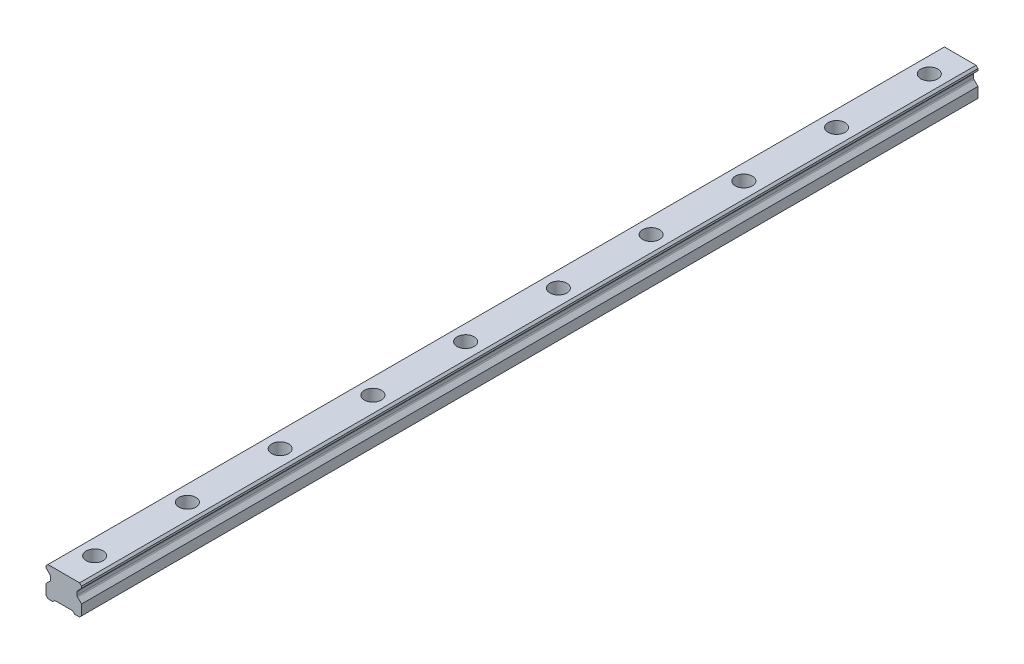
ISO-10303-21;
HEADER;
FILE_DESCRIPTION(('STEP AP214'),'2;1');
FILE_NAME('part.step','',(''),(''),'','','');
FILE_SCHEMA(('AUTOMOTIVE_DESIGN { 1 0 10303 214 1 1 1 1 }'));
ENDSEC;
DATA;
#1=APPLICATION_CONTEXT('core data for automotive mechanical design processes');
#2=APPLICATION_PROTOCOL_DEFINITION('international standard','automotive_design',2000,#1);
#3=PRODUCT_CONTEXT('',#1,'mechanical');
#4=PRODUCT('Part','Part','',(#3));
#5=PRODUCT_RELATED_PRODUCT_CATEGORY('part','',(#4));
#6=PRODUCT_DEFINITION_FORMATION('','',#4);
#7=PRODUCT_DEFINITION_CONTEXT('part definition',#1,'design');
#8=PRODUCT_DEFINITION('design','',#6,#7);
#9=PRODUCT_DEFINITION_SHAPE('','',#8);
#10=(LENGTH_UNIT() NAMED_UNIT(*) SI_UNIT(.MILLI.,.METRE.));
#11=(NAMED_UNIT(*) PLANE_ANGLE_UNIT() SI_UNIT($,.RADIAN.));
#12=(NAMED_UNIT(*) SI_UNIT($,.STERADIAN.) SOLID_ANGLE_UNIT());
#13=UNCERTAINTY_MEASURE_WITH_UNIT(LENGTH_MEASURE(1.E-05),#10,'distance_accuracy_value','');
#14=(GEOMETRIC_REPRESENTATION_CONTEXT(3) GLOBAL_UNCERTAINTY_ASSIGNED_CONTEXT((#13)) GLOBAL_UNIT_ASSIGNED_CONTEXT((#10,
#11,#12)) REPRESENTATION_CONTEXT('',''));
#15=CARTESIAN_POINT('',(0.,0.,0.));
#16=DIRECTION('',(0.,0.,1.));
#17=DIRECTION('',(1.,0.,0.));
#18=AXIS2_PLACEMENT_3D('',#15,#16,#17);
#19=CARTESIAN_POINT('',(0.,10.2,-270.));
#20=DIRECTION('',(0.,1.,0.));
#21=DIRECTION('',(0.,0.,1.));
#22=AXIS2_PLACEMENT_3D('',#19,#20,#21);
#23=PLANE('',#22);
#24=CARTESIAN_POINT('',(0.,10.2,-270.));
#25=DIRECTION('',(0.,1.,0.));
#26=DIRECTION('',(0.,0.,1.));
#27=AXIS2_PLACEMENT_3D('',#24,#25,#26);
#28=CIRCLE('',#27,3.5);
#29=CARTESIAN_POINT('',(0.,10.2,-266.5));
#30=VERTEX_POINT('',#29);
#31=EDGE_CURVE('E421',#30,#30,#28,.T.);
#32=ORIENTED_EDGE('',*,*,#31,.F.);
#33=EDGE_LOOP('',(#32));
#34=FACE_BOUND('',#33,.T.);
#35=CARTESIAN_POINT('',(0.,10.2,-270.));
#36=DIRECTION('',(0.,1.,0.));
#37=DIRECTION('',(0.,0.,1.));
#38=AXIS2_PLACEMENT_3D('',#35,#36,#37);
#39=CIRCLE('',#38,5.5);
#40=CARTESIAN_POINT('',(0.,10.2,-264.5));
#41=VERTEX_POINT('',#40);
#42=EDGE_CURVE('E11',#41,#41,#39,.T.);
#43=ORIENTED_EDGE('',*,*,#42,.T.);
#44=EDGE_LOOP('',(#43));
#45=FACE_BOUND('',#44,.T.);
#46=ADVANCED_FACE('F39',(#34,#45),#23,.T.);
#47=CARTESIAN_POINT('',(0.,10.2,-270.));
#48=DIRECTION('',(0.,1.,0.));
#49=DIRECTION('',(0.,0.,1.));
#50=AXIS2_PLACEMENT_3D('',#47,#48,#49);
#51=CYLINDRICAL_SURFACE('',#50,5.5);
#52=ORIENTED_EDGE('',*,*,#42,.F.);
#53=EDGE_LOOP('',(#52));
#54=FACE_BOUND('',#53,.T.);
#55=CARTESIAN_POINT('',(0.,19.2,-270.));
#56=DIRECTION('',(0.,1.,0.));
#57=DIRECTION('',(0.,0.,1.));
#58=AXIS2_PLACEMENT_3D('',#55,#56,#57);
#59=CIRCLE('',#58,5.5);
#60=CARTESIAN_POINT('',(0.,19.2,-264.5));
#61=VERTEX_POINT('',#60);
#62=EDGE_CURVE('E48',#61,#61,#59,.T.);
#63=ORIENTED_EDGE('',*,*,#62,.T.);
#64=EDGE_LOOP('',(#63));
#65=FACE_BOUND('',#64,.T.);
#66=ADVANCED_FACE('F679',(#54,#65),#51,.F.);
#67=CARTESIAN_POINT('',(0.,10.2,-210.));
#68=DIRECTION('',(0.,1.,0.));
#69=DIRECTION('',(0.,0.,1.));
#70=AXIS2_PLACEMENT_3D('',#67,#68,#69);
#71=PLANE('',#70);
#72=CARTESIAN_POINT('',(0.,10.2,-210.));
#73=DIRECTION('',(0.,1.,0.));
#74=DIRECTION('',(0.,0.,1.));
#75=AXIS2_PLACEMENT_3D('',#72,#73,#74);
#76=CIRCLE('',#75,3.5);
#77=CARTESIAN_POINT('',(0.,10.2,-206.5));
#78=VERTEX_POINT('',#77);
#79=EDGE_CURVE('E426',#78,#78,#76,.T.);
#80=ORIENTED_EDGE('',*,*,#79,.F.);
#81=EDGE_LOOP('',(#80));
#82=FACE_BOUND('',#81,.T.);
#83=CARTESIAN_POINT('',(0.,10.2,-210.));
#84=DIRECTION('',(0.,1.,0.));
#85=DIRECTION('',(0.,0.,1.));
#86=AXIS2_PLACEMENT_3D('',#83,#84,#85);
#87=CIRCLE('',#86,5.5);
#88=CARTESIAN_POINT('',(0.,10.2,-204.5));
#89=VERTEX_POINT('',#88);
#90=EDGE_CURVE('E405',#89,#89,#87,.T.);
#91=ORIENTED_EDGE('',*,*,#90,.T.);
#92=EDGE_LOOP('',(#91));
#93=FACE_BOUND('',#92,.T.);
#94=ADVANCED_FACE('F681',(#82,#93),#71,.T.);
#95=CARTESIAN_POINT('',(0.,10.2,-210.));
#96=DIRECTION('',(0.,1.,0.));
#97=DIRECTION('',(0.,0.,1.));
#98=AXIS2_PLACEMENT_3D('',#95,#96,#97);
#99=CYLINDRICAL_SURFACE('',#98,5.5);
#100=ORIENTED_EDGE('',*,*,#90,.F.);
#101=EDGE_LOOP('',(#100));
#102=FACE_BOUND('',#101,.T.);
#103=CARTESIAN_POINT('',(0.,19.2,-210.));
#104=DIRECTION('',(0.,1.,0.));
#105=DIRECTION('',(0.,0.,1.));
#106=AXIS2_PLACEMENT_3D('',#103,#104,#105);
#107=CIRCLE('',#106,5.5);
#108=CARTESIAN_POINT('',(0.,19.2,-204.5));
#109=VERTEX_POINT('',#108);
#110=EDGE_CURVE('E401',#109,#109,#107,.T.);
#111=ORIENTED_EDGE('',*,*,#110,.T.);
#112=EDGE_LOOP('',(#111));
#113=FACE_BOUND('',#112,.T.);
#114=ADVANCED_FACE('F687',(#102,#113),#99,.F.);
#115=CARTESIAN_POINT('',(0.,10.2,-150.));
#116=DIRECTION('',(0.,1.,0.));
#117=DIRECTION('',(0.,0.,1.));
#118=AXIS2_PLACEMENT_3D('',#115,#116,#117);
#119=PLANE('',#118);
#120=CARTESIAN_POINT('',(0.,10.2,-150.));
#121=DIRECTION('',(0.,1.,0.));
#122=DIRECTION('',(0.,0.,1.));
#123=AXIS2_PLACEMENT_3D('',#120,#121,#122);
#124=CIRCLE('',#123,3.5);
#125=CARTESIAN_POINT('',(0.,10.2,-146.5));
#126=VERTEX_POINT('',#125);
#127=EDGE_CURVE('E431',#126,#126,#124,.T.);
#128=ORIENTED_EDGE('',*,*,#127,.F.);
#129=EDGE_LOOP('',(#128));
#130=FACE_BOUND('',#129,.T.);
#131=CARTESIAN_POINT('',(0.,10.2,-150.));
#132=DIRECTION('',(0.,1.,0.));
#133=DIRECTION('',(0.,0.,1.));
#134=AXIS2_PLACEMENT_3D('',#131,#132,#133);
#135=CIRCLE('',#134,5.5);
#136=CARTESIAN_POINT('',(0.,10.2,-144.5));
#137=VERTEX_POINT('',#136);
#138=EDGE_CURVE('E397',#137,#137,#135,.T.);
#139=ORIENTED_EDGE('',*,*,#138,.T.);
#140=EDGE_LOOP('',(#139));
#141=FACE_BOUND('',#140,.T.);
#142=ADVANCED_FACE('F695',(#130,#141),#119,.T.);
#143=CARTESIAN_POINT('',(0.,10.2,-150.));
#144=DIRECTION('',(0.,1.,0.));
#145=DIRECTION('',(0.,0.,1.));
#146=AXIS2_PLACEMENT_3D('',#143,#144,#145);
#147=CYLINDRICAL_SURFACE('',#146,5.5);
#148=ORIENTED_EDGE('',*,*,#138,.F.);
#149=EDGE_LOOP('',(#148));
#150=FACE_BOUND('',#149,.T.);
#151=CARTESIAN_POINT('',(0.,19.2,-150.));
#152=DIRECTION('',(0.,1.,0.));
#153=DIRECTION('',(0.,0.,1.));
#154=AXIS2_PLACEMENT_3D('',#151,#152,#153);
#155=CIRCLE('',#154,5.5);
#156=CARTESIAN_POINT('',(0.,19.2,-144.5));
#157=VERTEX_POINT('',#156);
#158=EDGE_CURVE('E393',#157,#157,#155,.T.);
#159=ORIENTED_EDGE('',*,*,#158,.T.);
#160=EDGE_LOOP('',(#159));
#161=FACE_BOUND('',#160,.T.);
#162=ADVANCED_FACE('F657',(#150,#161),#147,.F.);
#163=CARTESIAN_POINT('',(0.,10.2,-90.));
#164=DIRECTION('',(0.,1.,0.));
#165=DIRECTION('',(0.,0.,1.));
#166=AXIS2_PLACEMENT_3D('',#163,#164,#165);
#167=PLANE('',#166);
#168=CARTESIAN_POINT('',(0.,10.2,-90.));
#169=DIRECTION('',(0.,1.,0.));
#170=DIRECTION('',(0.,0.,1.));
#171=AXIS2_PLACEMENT_3D('',#168,#169,#170);
#172=CIRCLE('',#171,3.5);
#173=CARTESIAN_POINT('',(0.,10.2,-86.5));
#174=VERTEX_POINT('',#173);
#175=EDGE_CURVE('E436',#174,#174,#172,.T.);
#176=ORIENTED_EDGE('',*,*,#175,.F.);
#177=EDGE_LOOP('',(#176));
#178=FACE_BOUND('',#177,.T.);
#179=CARTESIAN_POINT('',(0.,10.2,-90.));
#180=DIRECTION('',(0.,1.,0.));
#181=DIRECTION('',(0.,0.,1.));
#182=AXIS2_PLACEMENT_3D('',#179,#180,#181);
#183=CIRCLE('',#182,5.5);
#184=CARTESIAN_POINT('',(0.,10.2,-84.5));
#185=VERTEX_POINT('',#184);
#186=EDGE_CURVE('E389',#185,#185,#183,.T.);
#187=ORIENTED_EDGE('',*,*,#186,.T.);
#188=EDGE_LOOP('',(#187));
#189=FACE_BOUND('',#188,.T.);
#190=ADVANCED_FACE('F653',(#178,#189),#167,.T.);
#191=CARTESIAN_POINT('',(0.,10.2,-90.));
#192=DIRECTION('',(0.,1.,0.));
#193=DIRECTION('',(0.,0.,1.));
#194=AXIS2_PLACEMENT_3D('',#191,#192,#193);
#195=CYLINDRICAL_SURFACE('',#194,5.5);
#196=ORIENTED_EDGE('',*,*,#186,.F.);
#197=EDGE_LOOP('',(#196));
#198=FACE_BOUND('',#197,.T.);
#199=CARTESIAN_POINT('',(0.,19.2,-90.));
#200=DIRECTION('',(0.,1.,0.));
#201=DIRECTION('',(0.,0.,1.));
#202=AXIS2_PLACEMENT_3D('',#199,#200,#201);
#203=CIRCLE('',#202,5.5);
#204=CARTESIAN_POINT('',(0.,19.2,-84.5));
#205=VERTEX_POINT('',#204);
#206=EDGE_CURVE('E385',#205,#205,#203,.T.);
#207=ORIENTED_EDGE('',*,*,#206,.T.);
#208=EDGE_LOOP('',(#207));
#209=FACE_BOUND('',#208,.T.);
#210=ADVANCED_FACE('F656',(#198,#209),#195,.F.);
#211=CARTESIAN_POINT('',(0.,10.2,-30.));
#212=DIRECTION('',(0.,1.,0.));
#213=DIRECTION('',(0.,0.,1.));
#214=AXIS2_PLACEMENT_3D('',#211,#212,#213);
#215=PLANE('',#214);
#216=CARTESIAN_POINT('',(0.,10.2,-30.));
#217=DIRECTION('',(0.,1.,0.));
#218=DIRECTION('',(0.,0.,1.));
#219=AXIS2_PLACEMENT_3D('',#216,#217,#218);
#220=CIRCLE('',#219,3.5);
#221=CARTESIAN_POINT('',(0.,10.2,-26.5));
#222=VERTEX_POINT('',#221);
#223=EDGE_CURVE('E441',#222,#222,#220,.T.);
#224=ORIENTED_EDGE('',*,*,#223,.F.);
#225=EDGE_LOOP('',(#224));
#226=FACE_BOUND('',#225,.T.);
#227=CARTESIAN_POINT('',(0.,10.2,-30.));
#228=DIRECTION('',(0.,1.,0.));
#229=DIRECTION('',(0.,0.,1.));
#230=AXIS2_PLACEMENT_3D('',#227,#228,#229);
#231=CIRCLE('',#230,5.5);
#232=CARTESIAN_POINT('',(0.,10.2,-24.5));
#233=VERTEX_POINT('',#232);
#234=EDGE_CURVE('E381',#233,#233,#231,.T.);
#235=ORIENTED_EDGE('',*,*,#234,.T.);
#236=EDGE_LOOP('',(#235));
#237=FACE_BOUND('',#236,.T.);
#238=ADVANCED_FACE('F663',(#226,#237),#215,.T.);
#239=CARTESIAN_POINT('',(0.,10.2,-30.));
#240=DIRECTION('',(0.,1.,0.));
#241=DIRECTION('',(0.,0.,1.));
#242=AXIS2_PLACEMENT_3D('',#239,#240,#241);
#243=CYLINDRICAL_SURFACE('',#242,5.5);
#244=ORIENTED_EDGE('',*,*,#234,.F.);
#245=EDGE_LOOP('',(#244));
#246=FACE_BOUND('',#245,.T.);
#247=CARTESIAN_POINT('',(0.,19.2,-30.));
#248=DIRECTION('',(0.,1.,0.));
#249=DIRECTION('',(0.,0.,1.));
#250=AXIS2_PLACEMENT_3D('',#247,#248,#249);
#251=CIRCLE('',#250,5.5);
#252=CARTESIAN_POINT('',(0.,19.2,-24.5));
#253=VERTEX_POINT('',#252);
#254=EDGE_CURVE('E377',#253,#253,#251,.T.);
#255=ORIENTED_EDGE('',*,*,#254,.T.);
#256=EDGE_LOOP('',(#255));
#257=FACE_BOUND('',#256,.T.);
#258=ADVANCED_FACE('F705',(#246,#257),#243,.F.);
#259=CARTESIAN_POINT('',(0.,10.2,30.));
#260=DIRECTION('',(0.,1.,0.));
#261=DIRECTION('',(0.,0.,1.));
#262=AXIS2_PLACEMENT_3D('',#259,#260,#261);
#263=PLANE('',#262);
#264=CARTESIAN_POINT('',(0.,10.2,30.));
#265=DIRECTION('',(0.,1.,0.));
#266=DIRECTION('',(0.,0.,1.));
#267=AXIS2_PLACEMENT_3D('',#264,#265,#266);
#268=CIRCLE('',#267,3.5);
#269=CARTESIAN_POINT('',(0.,10.2,33.5));
#270=VERTEX_POINT('',#269);
#271=EDGE_CURVE('E445',#270,#270,#268,.T.);
#272=ORIENTED_EDGE('',*,*,#271,.F.);
#273=EDGE_LOOP('',(#272));
#274=FACE_BOUND('',#273,.T.);
#275=CARTESIAN_POINT('',(0.,10.2,30.));
#276=DIRECTION('',(0.,1.,0.));
#277=DIRECTION('',(0.,0.,1.));
#278=AXIS2_PLACEMENT_3D('',#275,#276,#277);
#279=CIRCLE('',#278,5.5);
#280=CARTESIAN_POINT('',(0.,10.2,35.5));
#281=VERTEX_POINT('',#280);
#282=EDGE_CURVE('E373',#281,#281,#279,.T.);
#283=ORIENTED_EDGE('',*,*,#282,.T.);
#284=EDGE_LOOP('',(#283));
#285=FACE_BOUND('',#284,.T.);
#286=ADVANCED_FACE('F709',(#274,#285),#263,.T.);
#287=CARTESIAN_POINT('',(0.,10.2,30.));
#288=DIRECTION('',(0.,1.,0.));
#289=DIRECTION('',(0.,0.,1.));
#290=AXIS2_PLACEMENT_3D('',#287,#288,#289);
#291=CYLINDRICAL_SURFACE('',#290,5.5);
#292=ORIENTED_EDGE('',*,*,#282,.F.);
#293=EDGE_LOOP('',(#292));
#294=FACE_BOUND('',#293,.T.);
#295=CARTESIAN_POINT('',(0.,19.2,30.));
#296=DIRECTION('',(0.,1.,0.));
#297=DIRECTION('',(0.,0.,1.));
#298=AXIS2_PLACEMENT_3D('',#295,#296,#297);
#299=CIRCLE('',#298,5.5);
#300=CARTESIAN_POINT('',(0.,19.2,35.5));
#301=VERTEX_POINT('',#300);
#302=EDGE_CURVE('E369',#301,#301,#299,.T.);
#303=ORIENTED_EDGE('',*,*,#302,.T.);
#304=EDGE_LOOP('',(#303));
#305=FACE_BOUND('',#304,.T.);
#306=ADVANCED_FACE('F713',(#294,#305),#291,.F.);
#307=CARTESIAN_POINT('',(0.,10.2,90.));
#308=DIRECTION('',(0.,1.,0.));
#309=DIRECTION('',(0.,0.,1.));
#310=AXIS2_PLACEMENT_3D('',#307,#308,#309);
#311=PLANE('',#310);
#312=CARTESIAN_POINT('',(0.,10.2,90.));
#313=DIRECTION('',(0.,1.,0.));
#314=DIRECTION('',(0.,0.,1.));
#315=AXIS2_PLACEMENT_3D('',#312,#313,#314);
#316=CIRCLE('',#315,3.5);
#317=CARTESIAN_POINT('',(0.,10.2,93.5));
#318=VERTEX_POINT('',#317);
#319=EDGE_CURVE('E449',#318,#318,#316,.T.);
#320=ORIENTED_EDGE('',*,*,#319,.F.);
#321=EDGE_LOOP('',(#320));
#322=FACE_BOUND('',#321,.T.);
#323=CARTESIAN_POINT('',(0.,10.2,90.));
#324=DIRECTION('',(0.,1.,0.));
#325=DIRECTION('',(0.,0.,1.));
#326=AXIS2_PLACEMENT_3D('',#323,#324,#325);
#327=CIRCLE('',#326,5.5);
#328=CARTESIAN_POINT('',(0.,10.2,95.5));
#329=VERTEX_POINT('',#328);
#330=EDGE_CURVE('E365',#329,#329,#327,.T.);
#331=ORIENTED_EDGE('',*,*,#330,.T.);
#332=EDGE_LOOP('',(#331));
#333=FACE_BOUND('',#332,.T.);
#334=ADVANCED_FACE('F717',(#322,#333),#311,.T.);
#335=CARTESIAN_POINT('',(0.,10.2,90.));
#336=DIRECTION('',(0.,1.,0.));
#337=DIRECTION('',(0.,0.,1.));
#338=AXIS2_PLACEMENT_3D('',#335,#336,#337);
#339=CYLINDRICAL_SURFACE('',#338,5.5);
#340=ORIENTED_EDGE('',*,*,#330,.F.);
#341=EDGE_LOOP('',(#340));
#342=FACE_BOUND('',#341,.T.);
#343=CARTESIAN_POINT('',(0.,19.2,90.));
#344=DIRECTION('',(0.,1.,0.));
#345=DIRECTION('',(0.,0.,1.));
#346=AXIS2_PLACEMENT_3D('',#343,#344,#345);
#347=CIRCLE('',#346,5.5);
#348=CARTESIAN_POINT('',(0.,19.2,95.5));
#349=VERTEX_POINT('',#348);
#350=EDGE_CURVE('E361',#349,#349,#347,.T.);
#351=ORIENTED_EDGE('',*,*,#350,.T.);
#352=EDGE_LOOP('',(#351));
#353=FACE_BOUND('',#352,.T.);
#354=ADVANCED_FACE('F721',(#342,#353),#339,.F.);
#355=CARTESIAN_POINT('',(0.,10.2,150.));
#356=DIRECTION('',(0.,1.,0.));
#357=DIRECTION('',(0.,0.,1.));
#358=AXIS2_PLACEMENT_3D('',#355,#356,#357);
#359=PLANE('',#358);
#360=CARTESIAN_POINT('',(0.,10.2,150.));
#361=DIRECTION('',(0.,1.,0.));
#362=DIRECTION('',(0.,0.,1.));
#363=AXIS2_PLACEMENT_3D('',#360,#361,#362);
#364=CIRCLE('',#363,3.5);
#365=CARTESIAN_POINT('',(0.,10.2,153.5));
#366=VERTEX_POINT('',#365);
#367=EDGE_CURVE('E465',#366,#366,#364,.T.);
#368=ORIENTED_EDGE('',*,*,#367,.F.);
#369=EDGE_LOOP('',(#368));
#370=FACE_BOUND('',#369,.T.);
#371=CARTESIAN_POINT('',(0.,10.2,150.));
#372=DIRECTION('',(0.,1.,0.));
#373=DIRECTION('',(0.,0.,1.));
#374=AXIS2_PLACEMENT_3D('',#371,#372,#373);
#375=CIRCLE('',#374,5.5);
#376=CARTESIAN_POINT('',(0.,10.2,155.5));
#377=VERTEX_POINT('',#376);
#378=EDGE_CURVE('E357',#377,#377,#375,.T.);
#379=ORIENTED_EDGE('',*,*,#378,.T.);
#380=EDGE_LOOP('',(#379));
#381=FACE_BOUND('',#380,.T.);
#382=ADVANCED_FACE('F725',(#370,#381),#359,.T.);
#383=CARTESIAN_POINT('',(0.,10.2,150.));
#384=DIRECTION('',(0.,1.,0.));
#385=DIRECTION('',(0.,0.,1.));
#386=AXIS2_PLACEMENT_3D('',#383,#384,#385);
#387=CYLINDRICAL_SURFACE('',#386,5.5);
#388=ORIENTED_EDGE('',*,*,#378,.F.);
#389=EDGE_LOOP('',(#388));
#390=FACE_BOUND('',#389,.T.);
#391=CARTESIAN_POINT('',(0.,19.2,150.));
#392=DIRECTION('',(0.,1.,0.));
#393=DIRECTION('',(0.,0.,1.));
#394=AXIS2_PLACEMENT_3D('',#391,#392,#393);
#395=CIRCLE('',#394,5.5);
#396=CARTESIAN_POINT('',(0.,19.2,155.5));
#397=VERTEX_POINT('',#396);
#398=EDGE_CURVE('E353',#397,#397,#395,.T.);
#399=ORIENTED_EDGE('',*,*,#398,.T.);
#400=EDGE_LOOP('',(#399));
#401=FACE_BOUND('',#400,.T.);
#402=ADVANCED_FACE('F729',(#390,#401),#387,.F.);
#403=CARTESIAN_POINT('',(11.5,0.,290.));
#404=DIRECTION('',(0.,1.,0.));
#405=DIRECTION('',(-1.,0.,0.));
#406=AXIS2_PLACEMENT_3D('',#403,#404,#405);
#407=PLANE('',#406);
#408=DIRECTION('',(1.,0.,0.));
#409=VECTOR('',#408,1.);
#410=CARTESIAN_POINT('',(11.5,0.,-290.));
#411=LINE('',#410,#409);
#412=CARTESIAN_POINT('',(-10.25,0.,-290.));
#413=VERTEX_POINT('',#412);
#414=CARTESIAN_POINT('',(-7.,0.,-290.));
#415=VERTEX_POINT('',#414);
#416=EDGE_CURVE('E229',#413,#415,#411,.T.);
#417=ORIENTED_EDGE('',*,*,#416,.T.);
#418=DIRECTION('',(0.,0.,1.));
#419=VECTOR('',#418,1.);
#420=CARTESIAN_POINT('',(-7.,0.,-290.));
#421=LINE('',#420,#419);
#422=CARTESIAN_POINT('',(-7.,0.,290.));
#423=VERTEX_POINT('',#422);
#424=EDGE_CURVE('E506',#415,#423,#421,.T.);
#425=ORIENTED_EDGE('',*,*,#424,.T.);
#426=DIRECTION('',(1.,0.,0.));
#427=VECTOR('',#426,1.);
#428=CARTESIAN_POINT('',(11.5,0.,290.));
#429=LINE('',#428,#427);
#430=CARTESIAN_POINT('',(-10.25,0.,290.));
#431=VERTEX_POINT('',#430);
#432=EDGE_CURVE('E574',#431,#423,#429,.T.);
#433=ORIENTED_EDGE('',*,*,#432,.F.);
#434=DIRECTION('',(0.,0.,-1.));
#435=VECTOR('',#434,1.);
#436=CARTESIAN_POINT('',(-10.25,0.,290.));
#437=LINE('',#436,#435);
#438=EDGE_CURVE('E289',#431,#413,#437,.T.);
#439=ORIENTED_EDGE('',*,*,#438,.T.);
#440=EDGE_LOOP('',(#417,#425,#433,#439));
#441=FACE_BOUND('',#440,.T.);
#442=ADVANCED_FACE('F733',(#441),#407,.F.);
#443=CARTESIAN_POINT('',(-11.5,19.2,290.));
#444=DIRECTION('',(1.,0.,0.));
#445=DIRECTION('',(0.,1.,0.));
#446=AXIS2_PLACEMENT_3D('',#443,#444,#445);
#447=PLANE('',#446);
#448=DIRECTION('',(0.,-1.,0.));
#449=VECTOR('',#448,1.);
#450=CARTESIAN_POINT('',(-11.5,19.2,290.));
#451=LINE('',#450,#449);
#452=CARTESIAN_POINT('',(-11.5,17.95,290.));
#453=VERTEX_POINT('',#452);
#454=CARTESIAN_POINT('',(-11.5,16.7,290.));
#455=VERTEX_POINT('',#454);
#456=EDGE_CURVE('E570',#453,#455,#451,.T.);
#457=ORIENTED_EDGE('',*,*,#456,.F.);
#458=DIRECTION('',(0.,0.,-1.));
#459=VECTOR('',#458,1.);
#460=CARTESIAN_POINT('',(-11.5,17.95,290.));
#461=LINE('',#460,#459);
#462=CARTESIAN_POINT('',(-11.5,17.95,-290.));
#463=VERTEX_POINT('',#462);
#464=EDGE_CURVE('E251',#453,#463,#461,.T.);
#465=ORIENTED_EDGE('',*,*,#464,.T.);
#466=DIRECTION('',(0.,-1.,0.));
#467=VECTOR('',#466,1.);
#468=CARTESIAN_POINT('',(-11.5,19.2,-290.));
#469=LINE('',#468,#467);
#470=CARTESIAN_POINT('',(-11.5,16.7,-290.));
#471=VERTEX_POINT('',#470);
#472=EDGE_CURVE('E230',#463,#471,#469,.T.);
#473=ORIENTED_EDGE('',*,*,#472,.T.);
#474=DIRECTION('',(0.,0.,1.));
#475=VECTOR('',#474,1.);
#476=CARTESIAN_POINT('',(-11.5,16.7,-290.));
#477=LINE('',#476,#475);
#478=EDGE_CURVE('E526',#471,#455,#477,.T.);
#479=ORIENTED_EDGE('',*,*,#478,.T.);
#480=EDGE_LOOP('',(#457,#465,#473,#479));
#481=FACE_BOUND('',#480,.T.);
#482=ADVANCED_FACE('F599',(#481),#447,.F.);
#483=CARTESIAN_POINT('',(11.5,19.2,290.));
#484=DIRECTION('',(-1.,0.,0.));
#485=DIRECTION('',(0.,0.,1.));
#486=AXIS2_PLACEMENT_3D('',#483,#484,#485);
#487=PLANE('',#486);
#488=DIRECTION('',(0.,1.,0.));
#489=VECTOR('',#488,1.);
#490=CARTESIAN_POINT('',(11.5,19.2,290.));
#491=LINE('',#490,#489);
#492=CARTESIAN_POINT('',(11.5,1.25000000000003,290.));
#493=VERTEX_POINT('',#492);
#494=CARTESIAN_POINT('',(11.5,7.95,290.));
#495=VERTEX_POINT('',#494);
#496=EDGE_CURVE('E579',#493,#495,#491,.T.);
#497=ORIENTED_EDGE('',*,*,#496,.F.);
#498=DIRECTION('',(0.,0.,-1.));
#499=VECTOR('',#498,1.);
#500=CARTESIAN_POINT('',(11.5,1.25000000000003,290.));
#501=LINE('',#500,#499);
#502=CARTESIAN_POINT('',(11.5,1.25000000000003,-290.));
#503=VERTEX_POINT('',#502);
#504=EDGE_CURVE('E296',#493,#503,#501,.T.);
#505=ORIENTED_EDGE('',*,*,#504,.T.);
#506=DIRECTION('',(0.,1.,0.));
#507=VECTOR('',#506,1.);
#508=CARTESIAN_POINT('',(11.5,19.2,-290.));
#509=LINE('',#508,#507);
#510=CARTESIAN_POINT('',(11.5,7.95,-290.));
#511=VERTEX_POINT('',#510);
#512=EDGE_CURVE('E242',#503,#511,#509,.T.);
#513=ORIENTED_EDGE('',*,*,#512,.T.);
#514=DIRECTION('',(0.,0.,1.));
#515=VECTOR('',#514,1.);
#516=CARTESIAN_POINT('',(11.5,7.95,-290.));
#517=LINE('',#516,#515);
#518=EDGE_CURVE('E555',#511,#495,#517,.T.);
#519=ORIENTED_EDGE('',*,*,#518,.T.);
#520=EDGE_LOOP('',(#497,#505,#513,#519));
#521=FACE_BOUND('',#520,.T.);
#522=ADVANCED_FACE('F764',(#521),#487,.F.);
#523=CARTESIAN_POINT('',(-11.5,7.95,-290.));
#524=VERTEX_POINT('',#523);
#525=CARTESIAN_POINT('',(-11.5,1.24999999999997,-290.));
#526=VERTEX_POINT('',#525);
#527=EDGE_CURVE('E238',#524,#526,#469,.T.);
#528=ORIENTED_EDGE('',*,*,#527,.T.);
#529=DIRECTION('',(0.,0.,1.));
#530=VECTOR('',#529,1.);
#531=CARTESIAN_POINT('',(-11.5,1.24999999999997,290.));
#532=LINE('',#531,#530);
#533=CARTESIAN_POINT('',(-11.5,1.24999999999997,290.));
#534=VERTEX_POINT('',#533);
#535=EDGE_CURVE('E293',#526,#534,#532,.T.);
#536=ORIENTED_EDGE('',*,*,#535,.T.);
#537=CARTESIAN_POINT('',(-11.5,7.95,290.));
#538=VERTEX_POINT('',#537);
#539=EDGE_CURVE('E250',#538,#534,#451,.T.);
#540=ORIENTED_EDGE('',*,*,#539,.F.);
#541=DIRECTION('',(0.,0.,1.));
#542=VECTOR('',#541,1.);
#543=CARTESIAN_POINT('',(-11.5,7.95,-290.));
#544=LINE('',#543,#542);
#545=EDGE_CURVE('E538',#524,#538,#544,.T.);
#546=ORIENTED_EDGE('',*,*,#545,.F.);
#547=EDGE_LOOP('',(#528,#536,#540,#546));
#548=FACE_BOUND('',#547,.T.);
#549=ADVANCED_FACE('F627',(#548),#447,.F.);
#550=CARTESIAN_POINT('',(7.,0.,290.));
#551=VERTEX_POINT('',#550);
#552=CARTESIAN_POINT('',(10.25,0.,290.));
#553=VERTEX_POINT('',#552);
#554=EDGE_CURVE('E219',#551,#553,#429,.T.);
#555=ORIENTED_EDGE('',*,*,#554,.F.);
#556=DIRECTION('',(0.,0.,1.));
#557=VECTOR('',#556,1.);
#558=CARTESIAN_POINT('',(7.,0.,-290.));
#559=LINE('',#558,#557);
#560=CARTESIAN_POINT('',(7.,0.,-290.));
#561=VERTEX_POINT('',#560);
#562=EDGE_CURVE('E206',#561,#551,#559,.T.);
#563=ORIENTED_EDGE('',*,*,#562,.F.);
#564=CARTESIAN_POINT('',(10.25,0.,-290.));
#565=VERTEX_POINT('',#564);
#566=EDGE_CURVE('E217',#561,#565,#411,.T.);
#567=ORIENTED_EDGE('',*,*,#566,.T.);
#568=DIRECTION('',(0.,0.,1.));
#569=VECTOR('',#568,1.);
#570=CARTESIAN_POINT('',(10.25,0.,290.));
#571=LINE('',#570,#569);
#572=EDGE_CURVE('E286',#565,#553,#571,.T.);
#573=ORIENTED_EDGE('',*,*,#572,.T.);
#574=EDGE_LOOP('',(#555,#563,#567,#573));
#575=FACE_BOUND('',#574,.T.);
#576=ADVANCED_FACE('F215',(#575),#407,.F.);
#577=CARTESIAN_POINT('',(11.5,16.7,-290.));
#578=VERTEX_POINT('',#577);
#579=CARTESIAN_POINT('',(11.5,17.95,-290.));
#580=VERTEX_POINT('',#579);
#581=EDGE_CURVE('E235',#578,#580,#509,.T.);
#582=ORIENTED_EDGE('',*,*,#581,.T.);
#583=DIRECTION('',(0.,0.,1.));
#584=VECTOR('',#583,1.);
#585=CARTESIAN_POINT('',(11.5,17.95,290.));
#586=LINE('',#585,#584);
#587=CARTESIAN_POINT('',(11.5,17.95,290.));
#588=VERTEX_POINT('',#587);
#589=EDGE_CURVE('E300',#580,#588,#586,.T.);
#590=ORIENTED_EDGE('',*,*,#589,.T.);
#591=CARTESIAN_POINT('',(11.5,16.7,290.));
#592=VERTEX_POINT('',#591);
#593=EDGE_CURVE('E578',#592,#588,#491,.T.);
#594=ORIENTED_EDGE('',*,*,#593,.F.);
#595=DIRECTION('',(0.,0.,1.));
#596=VECTOR('',#595,1.);
#597=CARTESIAN_POINT('',(11.5,16.7,-290.));
#598=LINE('',#597,#596);
#599=EDGE_CURVE('E531',#578,#592,#598,.T.);
#600=ORIENTED_EDGE('',*,*,#599,.F.);
#601=EDGE_LOOP('',(#582,#590,#594,#600));
#602=FACE_BOUND('',#601,.T.);
#603=ADVANCED_FACE('F670',(#602),#487,.F.);
#604=CARTESIAN_POINT('',(11.5,19.2,290.));
#605=DIRECTION('',(0.,-1.,0.));
#606=DIRECTION('',(0.,0.,-1.));
#607=AXIS2_PLACEMENT_3D('',#604,#605,#606);
#608=PLANE('',#607);
#609=CARTESIAN_POINT('',(0.,19.2,210.));
#610=DIRECTION('',(0.,1.,0.));
#611=DIRECTION('',(0.,0.,1.));
#612=AXIS2_PLACEMENT_3D('',#609,#610,#611);
#613=CIRCLE('',#612,5.5);
#614=CARTESIAN_POINT('',(0.,19.2,215.5));
#615=VERTEX_POINT('',#614);
#616=EDGE_CURVE('E469',#615,#615,#613,.T.);
#617=ORIENTED_EDGE('',*,*,#616,.F.);
#618=EDGE_LOOP('',(#617));
#619=FACE_BOUND('',#618,.T.);
#620=CARTESIAN_POINT('',(0.,19.2,270.));
#621=DIRECTION('',(0.,1.,0.));
#622=DIRECTION('',(0.,0.,1.));
#623=AXIS2_PLACEMENT_3D('',#620,#621,#622);
#624=CIRCLE('',#623,5.5);
#625=CARTESIAN_POINT('',(0.,19.2,275.5));
#626=VERTEX_POINT('',#625);
#627=EDGE_CURVE('E485',#626,#626,#624,.T.);
#628=ORIENTED_EDGE('',*,*,#627,.F.);
#629=EDGE_LOOP('',(#628));
#630=FACE_BOUND('',#629,.T.);
#631=DIRECTION('',(-1.,0.,0.));
#632=VECTOR('',#631,1.);
#633=CARTESIAN_POINT('',(11.5,19.2,-290.));
#634=LINE('',#633,#632);
#635=CARTESIAN_POINT('',(10.25,19.2,-290.));
#636=VERTEX_POINT('',#635);
#637=CARTESIAN_POINT('',(-10.2499999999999,19.2,-290.));
#638=VERTEX_POINT('',#637);
#639=EDGE_CURVE('E246',#636,#638,#634,.T.);
#640=ORIENTED_EDGE('',*,*,#639,.T.);
#641=DIRECTION('',(0.,0.,1.));
#642=VECTOR('',#641,1.);
#643=CARTESIAN_POINT('',(-10.2499999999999,19.2,290.));
#644=LINE('',#643,#642);
#645=CARTESIAN_POINT('',(-10.2499999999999,19.2,290.));
#646=VERTEX_POINT('',#645);
#647=EDGE_CURVE('E271',#638,#646,#644,.T.);
#648=ORIENTED_EDGE('',*,*,#647,.T.);
#649=DIRECTION('',(-1.,0.,0.));
#650=VECTOR('',#649,1.);
#651=CARTESIAN_POINT('',(11.5,19.2,290.));
#652=LINE('',#651,#650);
#653=CARTESIAN_POINT('',(10.25,19.2,290.));
#654=VERTEX_POINT('',#653);
#655=EDGE_CURVE('E256',#654,#646,#652,.T.);
#656=ORIENTED_EDGE('',*,*,#655,.F.);
#657=DIRECTION('',(0.,0.,-1.));
#658=VECTOR('',#657,1.);
#659=CARTESIAN_POINT('',(10.25,19.2,290.));
#660=LINE('',#659,#658);
#661=EDGE_CURVE('E267',#654,#636,#660,.T.);
#662=ORIENTED_EDGE('',*,*,#661,.T.);
#663=EDGE_LOOP('',(#640,#648,#656,#662));
#664=FACE_BOUND('',#663,.T.);
#665=ORIENTED_EDGE('',*,*,#398,.F.);
#666=EDGE_LOOP('',(#665));
#667=FACE_BOUND('',#666,.T.);
#668=ORIENTED_EDGE('',*,*,#350,.F.);
#669=EDGE_LOOP('',(#668));
#670=FACE_BOUND('',#669,.T.);
#671=ORIENTED_EDGE('',*,*,#302,.F.);
#672=EDGE_LOOP('',(#671));
#673=FACE_BOUND('',#672,.T.);
#674=ORIENTED_EDGE('',*,*,#254,.F.);
#675=EDGE_LOOP('',(#674));
#676=FACE_BOUND('',#675,.T.);
#677=ORIENTED_EDGE('',*,*,#206,.F.);
#678=EDGE_LOOP('',(#677));
#679=FACE_BOUND('',#678,.T.);
#680=ORIENTED_EDGE('',*,*,#158,.F.);
#681=EDGE_LOOP('',(#680));
#682=FACE_BOUND('',#681,.T.);
#683=ORIENTED_EDGE('',*,*,#110,.F.);
#684=EDGE_LOOP('',(#683));
#685=FACE_BOUND('',#684,.T.);
#686=ORIENTED_EDGE('',*,*,#62,.F.);
#687=EDGE_LOOP('',(#686));
#688=FACE_BOUND('',#687,.T.);
#689=ADVANCED_FACE('F667',(#619,#630,#664,#667,#670,#673,#676,#679,#682,#685,#688),#608,.F.);
#690=CARTESIAN_POINT('',(0.,0.,290.));
#691=DIRECTION('',(0.,0.,-1.));
#692=DIRECTION('',(-1.,0.,0.));
#693=AXIS2_PLACEMENT_3D('',#690,#691,#692);
#694=PLANE('',#693);
#695=ORIENTED_EDGE('',*,*,#432,.T.);
#696=DIRECTION('',(-0.707106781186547,-0.707106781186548,0.));
#697=VECTOR('',#696,1.);
#698=CARTESIAN_POINT('',(-7.,0.,290.));
#699=LINE('',#698,#697);
#700=CARTESIAN_POINT('',(-5.75,1.25,290.));
#701=VERTEX_POINT('',#700);
#702=EDGE_CURVE('E211',#701,#423,#699,.T.);
#703=ORIENTED_EDGE('',*,*,#702,.F.);
#704=DIRECTION('',(-1.,0.,0.));
#705=VECTOR('',#704,1.);
#706=CARTESIAN_POINT('',(-5.75,1.25,290.));
#707=LINE('',#706,#705);
#708=CARTESIAN_POINT('',(5.75,1.25,290.));
#709=VERTEX_POINT('',#708);
#710=EDGE_CURVE('E500',#709,#701,#707,.T.);
#711=ORIENTED_EDGE('',*,*,#710,.F.);
#712=DIRECTION('',(-0.707106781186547,0.707106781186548,0.));
#713=VECTOR('',#712,1.);
#714=CARTESIAN_POINT('',(5.75,1.25,290.));
#715=LINE('',#714,#713);
#716=EDGE_CURVE('E490',#551,#709,#715,.T.);
#717=ORIENTED_EDGE('',*,*,#716,.F.);
#718=ORIENTED_EDGE('',*,*,#554,.T.);
#719=DIRECTION('',(-0.707106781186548,-0.707106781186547,0.));
#720=VECTOR('',#719,1.);
#721=CARTESIAN_POINT('',(11.5,1.25000000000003,290.));
#722=LINE('',#721,#720);
#723=EDGE_CURVE('E277',#553,#493,#722,.F.);
#724=ORIENTED_EDGE('',*,*,#723,.T.);
#725=ORIENTED_EDGE('',*,*,#496,.T.);
#726=DIRECTION('',(0.707106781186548,-0.707106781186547,0.));
#727=VECTOR('',#726,1.);
#728=CARTESIAN_POINT('',(11.5,7.95,290.));
#729=LINE('',#728,#727);
#730=CARTESIAN_POINT('',(8.94944985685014,10.5005501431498,290.));
#731=VERTEX_POINT('',#730);
#732=EDGE_CURVE('E510',#731,#495,#729,.T.);
#733=ORIENTED_EDGE('',*,*,#732,.F.);
#734=CARTESIAN_POINT('',(9.83333333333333,11.384433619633,290.));
#735=DIRECTION('',(0.,0.,-1.));
#736=DIRECTION('',(-1.,0.,0.));
#737=AXIS2_PLACEMENT_3D('',#734,#735,#736);
#738=CIRCLE('',#737,1.25);
#739=CARTESIAN_POINT('',(8.58333333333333,11.384433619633,290.));
#740=VERTEX_POINT('',#739);
#741=EDGE_CURVE('E331',#731,#740,#738,.T.);
#742=ORIENTED_EDGE('',*,*,#741,.T.);
#743=DIRECTION('',(0.,-1.,0.));
#744=VECTOR('',#743,1.);
#745=CARTESIAN_POINT('',(8.58333333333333,10.8666666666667,290.));
#746=LINE('',#745,#744);
#747=CARTESIAN_POINT('',(8.58333333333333,13.265566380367,290.));
#748=VERTEX_POINT('',#747);
#749=EDGE_CURVE('E547',#748,#740,#746,.T.);
#750=ORIENTED_EDGE('',*,*,#749,.F.);
#751=CARTESIAN_POINT('',(9.83333333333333,13.265566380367,290.));
#752=DIRECTION('',(0.,0.,-1.));
#753=DIRECTION('',(-1.,0.,0.));
#754=AXIS2_PLACEMENT_3D('',#751,#752,#753);
#755=CIRCLE('',#754,1.25);
#756=CARTESIAN_POINT('',(8.94944985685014,14.1494498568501,290.));
#757=VERTEX_POINT('',#756);
#758=EDGE_CURVE('E336',#748,#757,#755,.T.);
#759=ORIENTED_EDGE('',*,*,#758,.T.);
#760=DIRECTION('',(-0.707106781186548,-0.707106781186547,0.));
#761=VECTOR('',#760,1.);
#762=CARTESIAN_POINT('',(8.58333333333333,13.7833333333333,290.));
#763=LINE('',#762,#761);
#764=EDGE_CURVE('E558',#592,#757,#763,.T.);
#765=ORIENTED_EDGE('',*,*,#764,.F.);
#766=ORIENTED_EDGE('',*,*,#593,.T.);
#767=DIRECTION('',(0.707106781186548,-0.707106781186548,0.));
#768=VECTOR('',#767,1.);
#769=CARTESIAN_POINT('',(10.25,19.2,290.));
#770=LINE('',#769,#768);
#771=EDGE_CURVE('E274',#588,#654,#770,.F.);
#772=ORIENTED_EDGE('',*,*,#771,.T.);
#773=ORIENTED_EDGE('',*,*,#655,.T.);
#774=DIRECTION('',(0.707106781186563,0.707106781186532,0.));
#775=VECTOR('',#774,1.);
#776=CARTESIAN_POINT('',(-11.5,17.95,290.));
#777=LINE('',#776,#775);
#778=EDGE_CURVE('E283',#646,#453,#777,.F.);
#779=ORIENTED_EDGE('',*,*,#778,.T.);
#780=ORIENTED_EDGE('',*,*,#456,.T.);
#781=DIRECTION('',(-0.707106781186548,0.707106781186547,0.));
#782=VECTOR('',#781,1.);
#783=CARTESIAN_POINT('',(-8.58333333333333,13.7833333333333,290.));
#784=LINE('',#783,#782);
#785=CARTESIAN_POINT('',(-8.94944985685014,14.1494498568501,290.));
#786=VERTEX_POINT('',#785);
#787=EDGE_CURVE('E527',#786,#455,#784,.T.);
#788=ORIENTED_EDGE('',*,*,#787,.F.);
#789=CARTESIAN_POINT('',(-9.83333333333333,13.265566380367,290.));
#790=DIRECTION('',(0.,0.,-1.));
#791=DIRECTION('',(-1.,0.,0.));
#792=AXIS2_PLACEMENT_3D('',#789,#790,#791);
#793=CIRCLE('',#792,1.25);
#794=CARTESIAN_POINT('',(-8.58333333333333,13.265566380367,290.));
#795=VERTEX_POINT('',#794);
#796=EDGE_CURVE('E348',#786,#795,#793,.T.);
#797=ORIENTED_EDGE('',*,*,#796,.T.);
#798=DIRECTION('',(0.,1.,0.));
#799=VECTOR('',#798,1.);
#800=CARTESIAN_POINT('',(-8.58333333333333,10.8666666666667,290.));
#801=LINE('',#800,#799);
#802=CARTESIAN_POINT('',(-8.58333333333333,11.384433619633,290.));
#803=VERTEX_POINT('',#802);
#804=EDGE_CURVE('E519',#803,#795,#801,.T.);
#805=ORIENTED_EDGE('',*,*,#804,.F.);
#806=CARTESIAN_POINT('',(-9.83333333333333,11.384433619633,290.));
#807=DIRECTION('',(0.,0.,-1.));
#808=DIRECTION('',(-1.,0.,0.));
#809=AXIS2_PLACEMENT_3D('',#806,#807,#808);
#810=CIRCLE('',#809,1.25);
#811=CARTESIAN_POINT('',(-8.94944985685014,10.5005501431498,290.));
#812=VERTEX_POINT('',#811);
#813=EDGE_CURVE('E342',#803,#812,#810,.T.);
#814=ORIENTED_EDGE('',*,*,#813,.T.);
#815=DIRECTION('',(0.707106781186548,0.707106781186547,0.));
#816=VECTOR('',#815,1.);
#817=CARTESIAN_POINT('',(-11.5,7.95,290.));
#818=LINE('',#817,#816);
#819=EDGE_CURVE('E530',#538,#812,#818,.T.);
#820=ORIENTED_EDGE('',*,*,#819,.F.);
#821=ORIENTED_EDGE('',*,*,#539,.T.);
#822=DIRECTION('',(-0.707106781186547,0.707106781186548,0.));
#823=VECTOR('',#822,1.);
#824=CARTESIAN_POINT('',(-10.25,0.,290.));
#825=LINE('',#824,#823);
#826=EDGE_CURVE('E280',#534,#431,#825,.F.);
#827=ORIENTED_EDGE('',*,*,#826,.T.);
#828=EDGE_LOOP('',(#695,#703,#711,#717,#718,#724,#725,#733,#742,#750,#759,#765,#766,#772,#773,
#779,#780,#788,#797,#805,#814,#820,#821,#827));
#829=FACE_BOUND('',#828,.T.);
#830=ADVANCED_FACE('F587',(#829),#694,.F.);
#831=CARTESIAN_POINT('',(0.,0.,-290.));
#832=DIRECTION('',(0.,0.,-1.));
#833=DIRECTION('',(-1.,0.,0.));
#834=AXIS2_PLACEMENT_3D('',#831,#832,#833);
#835=PLANE('',#834);
#836=DIRECTION('',(-0.707106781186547,-0.707106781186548,0.));
#837=VECTOR('',#836,1.);
#838=CARTESIAN_POINT('',(-7.,0.,-290.));
#839=LINE('',#838,#837);
#840=CARTESIAN_POINT('',(-5.75,1.25,-290.));
#841=VERTEX_POINT('',#840);
#842=EDGE_CURVE('E221',#841,#415,#839,.T.);
#843=ORIENTED_EDGE('',*,*,#842,.T.);
#844=ORIENTED_EDGE('',*,*,#416,.F.);
#845=DIRECTION('',(0.707106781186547,-0.707106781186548,0.));
#846=VECTOR('',#845,1.);
#847=CARTESIAN_POINT('',(-5.12500000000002,-5.12500000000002,-290.));
#848=LINE('',#847,#846);
#849=EDGE_CURVE('E261',#413,#526,#848,.F.);
#850=ORIENTED_EDGE('',*,*,#849,.T.);
#851=ORIENTED_EDGE('',*,*,#527,.F.);
#852=DIRECTION('',(0.707106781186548,0.707106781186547,0.));
#853=VECTOR('',#852,1.);
#854=CARTESIAN_POINT('',(-11.5,7.95,-290.));
#855=LINE('',#854,#853);
#856=CARTESIAN_POINT('',(-8.94944985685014,10.5005501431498,-290.));
#857=VERTEX_POINT('',#856);
#858=EDGE_CURVE('E518',#524,#857,#855,.T.);
#859=ORIENTED_EDGE('',*,*,#858,.T.);
#860=CARTESIAN_POINT('',(-9.83333333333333,11.384433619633,-290.));
#861=DIRECTION('',(0.,0.,-1.));
#862=DIRECTION('',(-1.,0.,0.));
#863=AXIS2_PLACEMENT_3D('',#860,#861,#862);
#864=CIRCLE('',#863,1.25);
#865=CARTESIAN_POINT('',(-8.58333333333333,11.384433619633,-290.));
#866=VERTEX_POINT('',#865);
#867=EDGE_CURVE('E345',#857,#866,#864,.F.);
#868=ORIENTED_EDGE('',*,*,#867,.T.);
#869=DIRECTION('',(0.,1.,0.));
#870=VECTOR('',#869,1.);
#871=CARTESIAN_POINT('',(-8.58333333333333,10.8666666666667,-290.));
#872=LINE('',#871,#870);
#873=CARTESIAN_POINT('',(-8.58333333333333,13.265566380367,-290.));
#874=VERTEX_POINT('',#873);
#875=EDGE_CURVE('E523',#866,#874,#872,.T.);
#876=ORIENTED_EDGE('',*,*,#875,.T.);
#877=CARTESIAN_POINT('',(-9.83333333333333,13.265566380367,-290.));
#878=DIRECTION('',(0.,0.,-1.));
#879=DIRECTION('',(-1.,0.,0.));
#880=AXIS2_PLACEMENT_3D('',#877,#878,#879);
#881=CIRCLE('',#880,1.25);
#882=CARTESIAN_POINT('',(-8.94944985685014,14.1494498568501,-290.));
#883=VERTEX_POINT('',#882);
#884=EDGE_CURVE('E64',#874,#883,#881,.F.);
#885=ORIENTED_EDGE('',*,*,#884,.T.);
#886=DIRECTION('',(-0.707106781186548,0.707106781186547,0.));
#887=VECTOR('',#886,1.);
#888=CARTESIAN_POINT('',(-8.58333333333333,13.7833333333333,-290.));
#889=LINE('',#888,#887);
#890=EDGE_CURVE('E515',#883,#471,#889,.T.);
#891=ORIENTED_EDGE('',*,*,#890,.T.);
#892=ORIENTED_EDGE('',*,*,#472,.F.);
#893=DIRECTION('',(-0.707106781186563,-0.707106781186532,0.));
#894=VECTOR('',#893,1.);
#895=CARTESIAN_POINT('',(-14.7249999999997,14.7250000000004,-290.));
#896=LINE('',#895,#894);
#897=EDGE_CURVE('E264',#463,#638,#896,.F.);
#898=ORIENTED_EDGE('',*,*,#897,.T.);
#899=ORIENTED_EDGE('',*,*,#639,.F.);
#900=DIRECTION('',(-0.707106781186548,0.707106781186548,0.));
#901=VECTOR('',#900,1.);
#902=CARTESIAN_POINT('',(14.725,14.725,-290.));
#903=LINE('',#902,#901);
#904=EDGE_CURVE('E255',#636,#580,#903,.F.);
#905=ORIENTED_EDGE('',*,*,#904,.T.);
#906=ORIENTED_EDGE('',*,*,#581,.F.);
#907=DIRECTION('',(-0.707106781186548,-0.707106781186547,0.));
#908=VECTOR('',#907,1.);
#909=CARTESIAN_POINT('',(8.58333333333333,13.7833333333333,-290.));
#910=LINE('',#909,#908);
#911=CARTESIAN_POINT('',(8.94944985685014,14.1494498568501,-290.));
#912=VERTEX_POINT('',#911);
#913=EDGE_CURVE('E546',#578,#912,#910,.T.);
#914=ORIENTED_EDGE('',*,*,#913,.T.);
#915=CARTESIAN_POINT('',(9.83333333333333,13.265566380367,-290.));
#916=DIRECTION('',(0.,0.,-1.));
#917=DIRECTION('',(-1.,0.,0.));
#918=AXIS2_PLACEMENT_3D('',#915,#916,#917);
#919=CIRCLE('',#918,1.25);
#920=CARTESIAN_POINT('',(8.58333333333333,13.265566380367,-290.));
#921=VERTEX_POINT('',#920);
#922=EDGE_CURVE('E339',#912,#921,#919,.F.);
#923=ORIENTED_EDGE('',*,*,#922,.T.);
#924=DIRECTION('',(0.,-1.,0.));
#925=VECTOR('',#924,1.);
#926=CARTESIAN_POINT('',(8.58333333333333,10.8666666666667,-290.));
#927=LINE('',#926,#925);
#928=CARTESIAN_POINT('',(8.58333333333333,11.384433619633,-290.));
#929=VERTEX_POINT('',#928);
#930=EDGE_CURVE('E551',#921,#929,#927,.T.);
#931=ORIENTED_EDGE('',*,*,#930,.T.);
#932=CARTESIAN_POINT('',(9.83333333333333,11.384433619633,-290.));
#933=DIRECTION('',(0.,0.,-1.));
#934=DIRECTION('',(-1.,0.,0.));
#935=AXIS2_PLACEMENT_3D('',#932,#933,#934);
#936=CIRCLE('',#935,1.25);
#937=CARTESIAN_POINT('',(8.94944985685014,10.5005501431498,-290.));
#938=VERTEX_POINT('',#937);
#939=EDGE_CURVE('E334',#929,#938,#936,.F.);
#940=ORIENTED_EDGE('',*,*,#939,.T.);
#941=DIRECTION('',(0.707106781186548,-0.707106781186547,0.));
#942=VECTOR('',#941,1.);
#943=CARTESIAN_POINT('',(11.5,7.95,-290.));
#944=LINE('',#943,#942);
#945=EDGE_CURVE('E543',#938,#511,#944,.T.);
#946=ORIENTED_EDGE('',*,*,#945,.T.);
#947=ORIENTED_EDGE('',*,*,#512,.F.);
#948=DIRECTION('',(0.707106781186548,0.707106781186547,0.));
#949=VECTOR('',#948,1.);
#950=CARTESIAN_POINT('',(5.12499999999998,-5.12499999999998,-290.));
#951=LINE('',#950,#949);
#952=EDGE_CURVE('E226',#503,#565,#951,.F.);
#953=ORIENTED_EDGE('',*,*,#952,.T.);
#954=ORIENTED_EDGE('',*,*,#566,.F.);
#955=DIRECTION('',(-0.707106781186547,0.707106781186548,0.));
#956=VECTOR('',#955,1.);
#957=CARTESIAN_POINT('',(5.75,1.25,-290.));
#958=LINE('',#957,#956);
#959=CARTESIAN_POINT('',(5.75,1.25,-290.));
#960=VERTEX_POINT('',#959);
#961=EDGE_CURVE('E202',#561,#960,#958,.T.);
#962=ORIENTED_EDGE('',*,*,#961,.T.);
#963=DIRECTION('',(-1.,0.,0.));
#964=VECTOR('',#963,1.);
#965=CARTESIAN_POINT('',(-5.75,1.25,-290.));
#966=LINE('',#965,#964);
#967=EDGE_CURVE('E56',#960,#841,#966,.T.);
#968=ORIENTED_EDGE('',*,*,#967,.T.);
#969=EDGE_LOOP('',(#843,#844,#850,#851,#859,#868,#876,#885,#891,#892,#898,#899,#905,#906,#914,
#923,#931,#940,#946,#947,#953,#954,#962,#968));
#970=FACE_BOUND('',#969,.T.);
#971=ADVANCED_FACE('F224',(#970),#835,.T.);
#972=CARTESIAN_POINT('',(11.5,7.95,-290.));
#973=DIRECTION('',(-0.707106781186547,-0.707106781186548,0.));
#974=DIRECTION('',(0.707106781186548,-0.707106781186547,0.));
#975=AXIS2_PLACEMENT_3D('',#972,#973,#974);
#976=PLANE('',#975);
#977=ORIENTED_EDGE('',*,*,#945,.F.);
#978=DIRECTION('',(0.,0.,1.));
#979=VECTOR('',#978,1.);
#980=CARTESIAN_POINT('',(8.94944985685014,10.5005501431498,290.));
#981=LINE('',#980,#979);
#982=EDGE_CURVE('E303',#938,#731,#981,.T.);
#983=ORIENTED_EDGE('',*,*,#982,.T.);
#984=ORIENTED_EDGE('',*,*,#732,.T.);
#985=ORIENTED_EDGE('',*,*,#518,.F.);
#986=EDGE_LOOP('',(#977,#983,#984,#985));
#987=FACE_BOUND('',#986,.T.);
#988=ADVANCED_FACE('F772',(#987),#976,.F.);
#989=CARTESIAN_POINT('',(8.58333333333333,10.8666666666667,-290.));
#990=DIRECTION('',(-1.,0.,0.));
#991=DIRECTION('',(0.,0.,1.));
#992=AXIS2_PLACEMENT_3D('',#989,#990,#991);
#993=PLANE('',#992);
#994=ORIENTED_EDGE('',*,*,#749,.T.);
#995=DIRECTION('',(0.,0.,1.));
#996=VECTOR('',#995,1.);
#997=CARTESIAN_POINT('',(8.58333333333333,11.384433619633,-290.));
#998=LINE('',#997,#996);
#999=EDGE_CURVE('E311',#740,#929,#998,.F.);
#1000=ORIENTED_EDGE('',*,*,#999,.T.);
#1001=ORIENTED_EDGE('',*,*,#930,.F.);
#1002=DIRECTION('',(0.,0.,1.));
#1003=VECTOR('',#1002,1.);
#1004=CARTESIAN_POINT('',(8.58333333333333,13.265566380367,290.));
#1005=LINE('',#1004,#1003);
#1006=EDGE_CURVE('E307',#921,#748,#1005,.T.);
#1007=ORIENTED_EDGE('',*,*,#1006,.T.);
#1008=EDGE_LOOP('',(#994,#1000,#1001,#1007));
#1009=FACE_BOUND('',#1008,.T.);
#1010=ADVANCED_FACE('F777',(#1009),#993,.F.);
#1011=CARTESIAN_POINT('',(8.58333333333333,13.7833333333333,-290.));
#1012=DIRECTION('',(-0.707106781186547,0.707106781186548,0.));
#1013=DIRECTION('',(-0.707106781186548,-0.707106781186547,0.));
#1014=AXIS2_PLACEMENT_3D('',#1011,#1012,#1013);
#1015=PLANE('',#1014);
#1016=ORIENTED_EDGE('',*,*,#764,.T.);
#1017=DIRECTION('',(0.,0.,1.));
#1018=VECTOR('',#1017,1.);
#1019=CARTESIAN_POINT('',(8.94944985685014,14.1494498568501,-290.));
#1020=LINE('',#1019,#1018);
#1021=EDGE_CURVE('E314',#757,#912,#1020,.F.);
#1022=ORIENTED_EDGE('',*,*,#1021,.T.);
#1023=ORIENTED_EDGE('',*,*,#913,.F.);
#1024=ORIENTED_EDGE('',*,*,#599,.T.);
#1025=EDGE_LOOP('',(#1016,#1022,#1023,#1024));
#1026=FACE_BOUND('',#1025,.T.);
#1027=ADVANCED_FACE('F779',(#1026),#1015,.F.);
#1028=CARTESIAN_POINT('',(-8.58333333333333,13.7833333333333,-290.));
#1029=DIRECTION('',(0.707106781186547,0.707106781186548,0.));
#1030=DIRECTION('',(-0.707106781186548,0.707106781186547,0.));
#1031=AXIS2_PLACEMENT_3D('',#1028,#1029,#1030);
#1032=PLANE('',#1031);
#1033=ORIENTED_EDGE('',*,*,#890,.F.);
#1034=DIRECTION('',(0.,0.,1.));
#1035=VECTOR('',#1034,1.);
#1036=CARTESIAN_POINT('',(-8.94944985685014,14.1494498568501,290.));
#1037=LINE('',#1036,#1035);
#1038=EDGE_CURVE('E327',#883,#786,#1037,.T.);
#1039=ORIENTED_EDGE('',*,*,#1038,.T.);
#1040=ORIENTED_EDGE('',*,*,#787,.T.);
#1041=ORIENTED_EDGE('',*,*,#478,.F.);
#1042=EDGE_LOOP('',(#1033,#1039,#1040,#1041));
#1043=FACE_BOUND('',#1042,.T.);
#1044=ADVANCED_FACE('F604',(#1043),#1032,.F.);
#1045=CARTESIAN_POINT('',(-8.58333333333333,10.8666666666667,-290.));
#1046=DIRECTION('',(1.,0.,0.));
#1047=DIRECTION('',(0.,0.,-1.));
#1048=AXIS2_PLACEMENT_3D('',#1045,#1046,#1047);
#1049=PLANE('',#1048);
#1050=ORIENTED_EDGE('',*,*,#875,.F.);
#1051=DIRECTION('',(0.,0.,1.));
#1052=VECTOR('',#1051,1.);
#1053=CARTESIAN_POINT('',(-8.58333333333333,11.384433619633,290.));
#1054=LINE('',#1053,#1052);
#1055=EDGE_CURVE('E320',#866,#803,#1054,.T.);
#1056=ORIENTED_EDGE('',*,*,#1055,.T.);
#1057=ORIENTED_EDGE('',*,*,#804,.T.);
#1058=DIRECTION('',(0.,0.,1.));
#1059=VECTOR('',#1058,1.);
#1060=CARTESIAN_POINT('',(-8.58333333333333,13.265566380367,-290.));
#1061=LINE('',#1060,#1059);
#1062=EDGE_CURVE('E317',#795,#874,#1061,.F.);
#1063=ORIENTED_EDGE('',*,*,#1062,.T.);
#1064=EDGE_LOOP('',(#1050,#1056,#1057,#1063));
#1065=FACE_BOUND('',#1064,.T.);
#1066=ADVANCED_FACE('F612',(#1065),#1049,.F.);
#1067=CARTESIAN_POINT('',(-11.5,7.95,-290.));
#1068=DIRECTION('',(0.707106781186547,-0.707106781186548,0.));
#1069=DIRECTION('',(0.707106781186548,0.707106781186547,0.));
#1070=AXIS2_PLACEMENT_3D('',#1067,#1068,#1069);
#1071=PLANE('',#1070);
#1072=ORIENTED_EDGE('',*,*,#819,.T.);
#1073=DIRECTION('',(0.,0.,1.));
#1074=VECTOR('',#1073,1.);
#1075=CARTESIAN_POINT('',(-8.94944985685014,10.5005501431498,-290.));
#1076=LINE('',#1075,#1074);
#1077=EDGE_CURVE('E324',#812,#857,#1076,.F.);
#1078=ORIENTED_EDGE('',*,*,#1077,.T.);
#1079=ORIENTED_EDGE('',*,*,#858,.F.);
#1080=ORIENTED_EDGE('',*,*,#545,.T.);
#1081=EDGE_LOOP('',(#1072,#1078,#1079,#1080));
#1082=FACE_BOUND('',#1081,.T.);
#1083=ADVANCED_FACE('F622',(#1082),#1071,.F.);
#1084=CARTESIAN_POINT('',(-11.5,17.95,290.));
#1085=DIRECTION('',(0.707106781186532,-0.707106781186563,0.));
#1086=DIRECTION('',(0.,0.,-1.));
#1087=AXIS2_PLACEMENT_3D('',#1084,#1085,#1086);
#1088=PLANE('',#1087);
#1089=ORIENTED_EDGE('',*,*,#778,.F.);
#1090=ORIENTED_EDGE('',*,*,#647,.F.);
#1091=ORIENTED_EDGE('',*,*,#897,.F.);
#1092=ORIENTED_EDGE('',*,*,#464,.F.);
#1093=EDGE_LOOP('',(#1089,#1090,#1091,#1092));
#1094=FACE_BOUND('',#1093,.T.);
#1095=ADVANCED_FACE('F596',(#1094),#1088,.F.);
#1096=CARTESIAN_POINT('',(-10.25,0.,290.));
#1097=DIRECTION('',(0.707106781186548,0.707106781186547,0.));
#1098=DIRECTION('',(0.,0.,-1.));
#1099=AXIS2_PLACEMENT_3D('',#1096,#1097,#1098);
#1100=PLANE('',#1099);
#1101=ORIENTED_EDGE('',*,*,#826,.F.);
#1102=ORIENTED_EDGE('',*,*,#535,.F.);
#1103=ORIENTED_EDGE('',*,*,#849,.F.);
#1104=ORIENTED_EDGE('',*,*,#438,.F.);
#1105=EDGE_LOOP('',(#1101,#1102,#1103,#1104));
#1106=FACE_BOUND('',#1105,.T.);
#1107=ADVANCED_FACE('F755',(#1106),#1100,.F.);
#1108=CARTESIAN_POINT('',(11.5,1.25000000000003,290.));
#1109=DIRECTION('',(-0.707106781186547,0.707106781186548,0.));
#1110=DIRECTION('',(0.,0.,-1.));
#1111=AXIS2_PLACEMENT_3D('',#1108,#1109,#1110);
#1112=PLANE('',#1111);
#1113=ORIENTED_EDGE('',*,*,#723,.F.);
#1114=ORIENTED_EDGE('',*,*,#572,.F.);
#1115=ORIENTED_EDGE('',*,*,#952,.F.);
#1116=ORIENTED_EDGE('',*,*,#504,.F.);
#1117=EDGE_LOOP('',(#1113,#1114,#1115,#1116));
#1118=FACE_BOUND('',#1117,.T.);
#1119=ADVANCED_FACE('F751',(#1118),#1112,.F.);
#1120=CARTESIAN_POINT('',(10.25,19.2,290.));
#1121=DIRECTION('',(-0.707106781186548,-0.707106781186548,0.));
#1122=DIRECTION('',(0.,0.,-1.));
#1123=AXIS2_PLACEMENT_3D('',#1120,#1121,#1122);
#1124=PLANE('',#1123);
#1125=ORIENTED_EDGE('',*,*,#771,.F.);
#1126=ORIENTED_EDGE('',*,*,#589,.F.);
#1127=ORIENTED_EDGE('',*,*,#904,.F.);
#1128=ORIENTED_EDGE('',*,*,#661,.F.);
#1129=EDGE_LOOP('',(#1125,#1126,#1127,#1128));
#1130=FACE_BOUND('',#1129,.T.);
#1131=ADVANCED_FACE('F747',(#1130),#1124,.F.);
#1132=CARTESIAN_POINT('',(9.83333333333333,11.384433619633,-290.));
#1133=DIRECTION('',(0.,0.,-1.));
#1134=DIRECTION('',(-1.,0.,0.));
#1135=AXIS2_PLACEMENT_3D('',#1132,#1133,#1134);
#1136=CYLINDRICAL_SURFACE('',#1135,1.25);
#1137=ORIENTED_EDGE('',*,*,#939,.F.);
#1138=ORIENTED_EDGE('',*,*,#999,.F.);
#1139=ORIENTED_EDGE('',*,*,#741,.F.);
#1140=ORIENTED_EDGE('',*,*,#982,.F.);
#1141=EDGE_LOOP('',(#1137,#1138,#1139,#1140));
#1142=FACE_BOUND('',#1141,.T.);
#1143=ADVANCED_FACE('F743',(#1142),#1136,.F.);
#1144=CARTESIAN_POINT('',(9.83333333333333,13.265566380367,-290.));
#1145=DIRECTION('',(0.,0.,-1.));
#1146=DIRECTION('',(-1.,0.,0.));
#1147=AXIS2_PLACEMENT_3D('',#1144,#1145,#1146);
#1148=CYLINDRICAL_SURFACE('',#1147,1.25);
#1149=ORIENTED_EDGE('',*,*,#922,.F.);
#1150=ORIENTED_EDGE('',*,*,#1021,.F.);
#1151=ORIENTED_EDGE('',*,*,#758,.F.);
#1152=ORIENTED_EDGE('',*,*,#1006,.F.);
#1153=EDGE_LOOP('',(#1149,#1150,#1151,#1152));
#1154=FACE_BOUND('',#1153,.T.);
#1155=ADVANCED_FACE('F740',(#1154),#1148,.F.);
#1156=CARTESIAN_POINT('',(-9.83333333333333,11.384433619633,-290.));
#1157=DIRECTION('',(0.,0.,-1.));
#1158=DIRECTION('',(-1.,0.,0.));
#1159=AXIS2_PLACEMENT_3D('',#1156,#1157,#1158);
#1160=CYLINDRICAL_SURFACE('',#1159,1.25);
#1161=ORIENTED_EDGE('',*,*,#867,.F.);
#1162=ORIENTED_EDGE('',*,*,#1077,.F.);
#1163=ORIENTED_EDGE('',*,*,#813,.F.);
#1164=ORIENTED_EDGE('',*,*,#1055,.F.);
#1165=EDGE_LOOP('',(#1161,#1162,#1163,#1164));
#1166=FACE_BOUND('',#1165,.T.);
#1167=ADVANCED_FACE('F616',(#1166),#1160,.F.);
#1168=CARTESIAN_POINT('',(-9.83333333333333,13.265566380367,-290.));
#1169=DIRECTION('',(0.,0.,-1.));
#1170=DIRECTION('',(-1.,0.,0.));
#1171=AXIS2_PLACEMENT_3D('',#1168,#1169,#1170);
#1172=CYLINDRICAL_SURFACE('',#1171,1.25);
#1173=ORIENTED_EDGE('',*,*,#884,.F.);
#1174=ORIENTED_EDGE('',*,*,#1062,.F.);
#1175=ORIENTED_EDGE('',*,*,#796,.F.);
#1176=ORIENTED_EDGE('',*,*,#1038,.F.);
#1177=EDGE_LOOP('',(#1173,#1174,#1175,#1176));
#1178=FACE_BOUND('',#1177,.T.);
#1179=ADVANCED_FACE('F607',(#1178),#1172,.F.);
#1180=CARTESIAN_POINT('',(-7.,0.,-290.));
#1181=DIRECTION('',(-0.707106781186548,0.707106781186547,0.));
#1182=DIRECTION('',(-0.707106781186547,-0.707106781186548,0.));
#1183=AXIS2_PLACEMENT_3D('',#1180,#1181,#1182);
#1184=PLANE('',#1183);
#1185=ORIENTED_EDGE('',*,*,#702,.T.);
#1186=ORIENTED_EDGE('',*,*,#424,.F.);
#1187=ORIENTED_EDGE('',*,*,#842,.F.);
#1188=DIRECTION('',(0.,0.,1.));
#1189=VECTOR('',#1188,1.);
#1190=CARTESIAN_POINT('',(-5.75,1.25,-290.));
#1191=LINE('',#1190,#1189);
#1192=EDGE_CURVE('E511',#841,#701,#1191,.T.);
#1193=ORIENTED_EDGE('',*,*,#1192,.T.);
#1194=EDGE_LOOP('',(#1185,#1186,#1187,#1193));
#1195=FACE_BOUND('',#1194,.T.);
#1196=ADVANCED_FACE('F737',(#1195),#1184,.F.);
#1197=CARTESIAN_POINT('',(-5.75,1.25,-290.));
#1198=DIRECTION('',(0.,1.,0.));
#1199=DIRECTION('',(0.,0.,1.));
#1200=AXIS2_PLACEMENT_3D('',#1197,#1198,#1199);
#1201=PLANE('',#1200);
#1202=CARTESIAN_POINT('',(0.,1.25,210.));
#1203=DIRECTION('',(0.,1.,0.));
#1204=DIRECTION('',(0.,0.,1.));
#1205=AXIS2_PLACEMENT_3D('',#1202,#1203,#1204);
#1206=CIRCLE('',#1205,3.5);
#1207=CARTESIAN_POINT('',(0.,1.25,213.5));
#1208=VERTEX_POINT('',#1207);
#1209=EDGE_CURVE('E416',#1208,#1208,#1206,.T.);
#1210=ORIENTED_EDGE('',*,*,#1209,.T.);
#1211=EDGE_LOOP('',(#1210));
#1212=FACE_BOUND('',#1211,.T.);
#1213=CARTESIAN_POINT('',(0.,1.25,150.));
#1214=DIRECTION('',(0.,1.,0.));
#1215=DIRECTION('',(0.,0.,1.));
#1216=AXIS2_PLACEMENT_3D('',#1213,#1214,#1215);
#1217=CIRCLE('',#1216,3.5);
#1218=CARTESIAN_POINT('',(0.,1.25,153.5));
#1219=VERTEX_POINT('',#1218);
#1220=EDGE_CURVE('E42',#1219,#1219,#1217,.T.);
#1221=ORIENTED_EDGE('',*,*,#1220,.T.);
#1222=EDGE_LOOP('',(#1221));
#1223=FACE_BOUND('',#1222,.T.);
#1224=CARTESIAN_POINT('',(0.,1.25,90.));
#1225=DIRECTION('',(0.,1.,0.));
#1226=DIRECTION('',(0.,0.,1.));
#1227=AXIS2_PLACEMENT_3D('',#1224,#1225,#1226);
#1228=CIRCLE('',#1227,3.5);
#1229=CARTESIAN_POINT('',(0.,1.25,93.5));
#1230=VERTEX_POINT('',#1229);
#1231=EDGE_CURVE('E446',#1230,#1230,#1228,.T.);
#1232=ORIENTED_EDGE('',*,*,#1231,.T.);
#1233=EDGE_LOOP('',(#1232));
#1234=FACE_BOUND('',#1233,.T.);
#1235=CARTESIAN_POINT('',(0.,1.25,30.));
#1236=DIRECTION('',(0.,1.,0.));
#1237=DIRECTION('',(0.,0.,1.));
#1238=AXIS2_PLACEMENT_3D('',#1235,#1236,#1237);
#1239=CIRCLE('',#1238,3.5);
#1240=CARTESIAN_POINT('',(0.,1.25,33.5));
#1241=VERTEX_POINT('',#1240);
#1242=EDGE_CURVE('E442',#1241,#1241,#1239,.T.);
#1243=ORIENTED_EDGE('',*,*,#1242,.T.);
#1244=EDGE_LOOP('',(#1243));
#1245=FACE_BOUND('',#1244,.T.);
#1246=CARTESIAN_POINT('',(0.,1.25,-30.));
#1247=DIRECTION('',(0.,1.,0.));
#1248=DIRECTION('',(0.,0.,1.));
#1249=AXIS2_PLACEMENT_3D('',#1246,#1247,#1248);
#1250=CIRCLE('',#1249,3.5);
#1251=CARTESIAN_POINT('',(0.,1.25,-26.5));
#1252=VERTEX_POINT('',#1251);
#1253=EDGE_CURVE('E437',#1252,#1252,#1250,.T.);
#1254=ORIENTED_EDGE('',*,*,#1253,.T.);
#1255=EDGE_LOOP('',(#1254));
#1256=FACE_BOUND('',#1255,.T.);
#1257=CARTESIAN_POINT('',(0.,1.25,-90.));
#1258=DIRECTION('',(0.,1.,0.));
#1259=DIRECTION('',(0.,0.,1.));
#1260=AXIS2_PLACEMENT_3D('',#1257,#1258,#1259);
#1261=CIRCLE('',#1260,3.5);
#1262=CARTESIAN_POINT('',(0.,1.25,-86.5));
#1263=VERTEX_POINT('',#1262);
#1264=EDGE_CURVE('E432',#1263,#1263,#1261,.T.);
#1265=ORIENTED_EDGE('',*,*,#1264,.T.);
#1266=EDGE_LOOP('',(#1265));
#1267=FACE_BOUND('',#1266,.T.);
#1268=CARTESIAN_POINT('',(0.,1.25,-150.));
#1269=DIRECTION('',(0.,1.,0.));
#1270=DIRECTION('',(0.,0.,1.));
#1271=AXIS2_PLACEMENT_3D('',#1268,#1269,#1270);
#1272=CIRCLE('',#1271,3.5);
#1273=CARTESIAN_POINT('',(0.,1.25,-146.5));
#1274=VERTEX_POINT('',#1273);
#1275=EDGE_CURVE('E427',#1274,#1274,#1272,.T.);
#1276=ORIENTED_EDGE('',*,*,#1275,.T.);
#1277=EDGE_LOOP('',(#1276));
#1278=FACE_BOUND('',#1277,.T.);
#1279=CARTESIAN_POINT('',(0.,1.25,-210.));
#1280=DIRECTION('',(0.,1.,0.));
#1281=DIRECTION('',(0.,0.,1.));
#1282=AXIS2_PLACEMENT_3D('',#1279,#1280,#1281);
#1283=CIRCLE('',#1282,3.5);
#1284=CARTESIAN_POINT('',(0.,1.25,-206.5));
#1285=VERTEX_POINT('',#1284);
#1286=EDGE_CURVE('E422',#1285,#1285,#1283,.T.);
#1287=ORIENTED_EDGE('',*,*,#1286,.T.);
#1288=EDGE_LOOP('',(#1287));
#1289=FACE_BOUND('',#1288,.T.);
#1290=CARTESIAN_POINT('',(0.,1.25,-270.));
#1291=DIRECTION('',(0.,1.,0.));
#1292=DIRECTION('',(0.,0.,1.));
#1293=AXIS2_PLACEMENT_3D('',#1290,#1291,#1292);
#1294=CIRCLE('',#1293,3.5);
#1295=CARTESIAN_POINT('',(0.,1.25,-266.5));
#1296=VERTEX_POINT('',#1295);
#1297=EDGE_CURVE('E417',#1296,#1296,#1294,.T.);
#1298=ORIENTED_EDGE('',*,*,#1297,.T.);
#1299=EDGE_LOOP('',(#1298));
#1300=FACE_BOUND('',#1299,.T.);
#1301=CARTESIAN_POINT('',(0.,1.25,270.));
#1302=DIRECTION('',(0.,1.,0.));
#1303=DIRECTION('',(0.,0.,1.));
#1304=AXIS2_PLACEMENT_3D('',#1301,#1302,#1303);
#1305=CIRCLE('',#1304,3.5);
#1306=CARTESIAN_POINT('',(0.,1.25,273.5));
#1307=VERTEX_POINT('',#1306);
#1308=EDGE_CURVE('E481',#1307,#1307,#1305,.T.);
#1309=ORIENTED_EDGE('',*,*,#1308,.T.);
#1310=EDGE_LOOP('',(#1309));
#1311=FACE_BOUND('',#1310,.T.);
#1312=ORIENTED_EDGE('',*,*,#710,.T.);
#1313=ORIENTED_EDGE('',*,*,#1192,.F.);
#1314=ORIENTED_EDGE('',*,*,#967,.F.);
#1315=DIRECTION('',(0.,0.,1.));
#1316=VECTOR('',#1315,1.);
#1317=CARTESIAN_POINT('',(5.75,1.25,-290.));
#1318=LINE('',#1317,#1316);
#1319=EDGE_CURVE('E208',#960,#709,#1318,.T.);
#1320=ORIENTED_EDGE('',*,*,#1319,.T.);
#1321=EDGE_LOOP('',(#1312,#1313,#1314,#1320));
#1322=FACE_BOUND('',#1321,.T.);
#1323=ADVANCED_FACE('F795',(#1212,#1223,#1234,#1245,#1256,#1267,#1278,#1289,#1300,#1311,#1322),
#1201,.F.);
#1324=CARTESIAN_POINT('',(5.75,1.25,-290.));
#1325=DIRECTION('',(0.707106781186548,0.707106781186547,0.));
#1326=DIRECTION('',(-0.707106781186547,0.707106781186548,0.));
#1327=AXIS2_PLACEMENT_3D('',#1324,#1325,#1326);
#1328=PLANE('',#1327);
#1329=ORIENTED_EDGE('',*,*,#716,.T.);
#1330=ORIENTED_EDGE('',*,*,#1319,.F.);
#1331=ORIENTED_EDGE('',*,*,#961,.F.);
#1332=ORIENTED_EDGE('',*,*,#562,.T.);
#1333=EDGE_LOOP('',(#1329,#1330,#1331,#1332));
#1334=FACE_BOUND('',#1333,.T.);
#1335=ADVANCED_FACE('F205',(#1334),#1328,.F.);
#1336=CARTESIAN_POINT('',(0.,10.2,270.));
#1337=DIRECTION('',(0.,1.,0.));
#1338=DIRECTION('',(0.,0.,1.));
#1339=AXIS2_PLACEMENT_3D('',#1336,#1337,#1338);
#1340=CYLINDRICAL_SURFACE('',#1339,5.5);
#1341=CARTESIAN_POINT('',(0.,10.2,270.));
#1342=DIRECTION('',(0.,1.,0.));
#1343=DIRECTION('',(0.,0.,1.));
#1344=AXIS2_PLACEMENT_3D('',#1341,#1342,#1343);
#1345=CIRCLE('',#1344,5.5);
#1346=CARTESIAN_POINT('',(0.,10.2,275.5));
#1347=VERTEX_POINT('',#1346);
#1348=EDGE_CURVE('E486',#1347,#1347,#1345,.T.);
#1349=ORIENTED_EDGE('',*,*,#1348,.F.);
#1350=EDGE_LOOP('',(#1349));
#1351=FACE_BOUND('',#1350,.T.);
#1352=ORIENTED_EDGE('',*,*,#627,.T.);
#1353=EDGE_LOOP('',(#1352));
#1354=FACE_BOUND('',#1353,.T.);
#1355=ADVANCED_FACE('F794',(#1351,#1354),#1340,.F.);
#1356=CARTESIAN_POINT('',(0.,10.2,270.));
#1357=DIRECTION('',(0.,1.,0.));
#1358=DIRECTION('',(0.,0.,1.));
#1359=AXIS2_PLACEMENT_3D('',#1356,#1357,#1358);
#1360=PLANE('',#1359);
#1361=CARTESIAN_POINT('',(0.,10.2,270.));
#1362=DIRECTION('',(0.,1.,0.));
#1363=DIRECTION('',(0.,0.,1.));
#1364=AXIS2_PLACEMENT_3D('',#1361,#1362,#1363);
#1365=CIRCLE('',#1364,3.5);
#1366=CARTESIAN_POINT('',(0.,10.2,273.5));
#1367=VERTEX_POINT('',#1366);
#1368=EDGE_CURVE('E477',#1367,#1367,#1365,.T.);
#1369=ORIENTED_EDGE('',*,*,#1368,.F.);
#1370=EDGE_LOOP('',(#1369));
#1371=FACE_BOUND('',#1370,.T.);
#1372=ORIENTED_EDGE('',*,*,#1348,.T.);
#1373=EDGE_LOOP('',(#1372));
#1374=FACE_BOUND('',#1373,.T.);
#1375=ADVANCED_FACE('F804',(#1371,#1374),#1360,.T.);
#1376=CARTESIAN_POINT('',(0.,0.,270.));
#1377=DIRECTION('',(0.,1.,0.));
#1378=DIRECTION('',(0.,0.,1.));
#1379=AXIS2_PLACEMENT_3D('',#1376,#1377,#1378);
#1380=CYLINDRICAL_SURFACE('',#1379,3.5);
#1381=ORIENTED_EDGE('',*,*,#1368,.T.);
#1382=EDGE_LOOP('',(#1381));
#1383=FACE_BOUND('',#1382,.T.);
#1384=ORIENTED_EDGE('',*,*,#1308,.F.);
#1385=EDGE_LOOP('',(#1384));
#1386=FACE_BOUND('',#1385,.T.);
#1387=ADVANCED_FACE('F808',(#1383,#1386),#1380,.F.);
#1388=CARTESIAN_POINT('',(0.,10.2,210.));
#1389=DIRECTION('',(0.,1.,0.));
#1390=DIRECTION('',(0.,0.,1.));
#1391=AXIS2_PLACEMENT_3D('',#1388,#1389,#1390);
#1392=CYLINDRICAL_SURFACE('',#1391,5.5);
#1393=CARTESIAN_POINT('',(0.,10.2,210.));
#1394=DIRECTION('',(0.,1.,0.));
#1395=DIRECTION('',(0.,0.,1.));
#1396=AXIS2_PLACEMENT_3D('',#1393,#1394,#1395);
#1397=CIRCLE('',#1396,5.5);
#1398=CARTESIAN_POINT('',(0.,10.2,215.5));
#1399=VERTEX_POINT('',#1398);
#1400=EDGE_CURVE('E473',#1399,#1399,#1397,.T.);
#1401=ORIENTED_EDGE('',*,*,#1400,.F.);
#1402=EDGE_LOOP('',(#1401));
#1403=FACE_BOUND('',#1402,.T.);
#1404=ORIENTED_EDGE('',*,*,#616,.T.);
#1405=EDGE_LOOP('',(#1404));
#1406=FACE_BOUND('',#1405,.T.);
#1407=ADVANCED_FACE('F812',(#1403,#1406),#1392,.F.);
#1408=CARTESIAN_POINT('',(0.,10.2,210.));
#1409=DIRECTION('',(0.,1.,0.));
#1410=DIRECTION('',(0.,0.,1.));
#1411=AXIS2_PLACEMENT_3D('',#1408,#1409,#1410);
#1412=PLANE('',#1411);
#1413=CARTESIAN_POINT('',(0.,10.2,210.));
#1414=DIRECTION('',(0.,1.,0.));
#1415=DIRECTION('',(0.,0.,1.));
#1416=AXIS2_PLACEMENT_3D('',#1413,#1414,#1415);
#1417=CIRCLE('',#1416,3.5);
#1418=CARTESIAN_POINT('',(0.,10.2,213.5));
#1419=VERTEX_POINT('',#1418);
#1420=EDGE_CURVE('E412',#1419,#1419,#1417,.T.);
#1421=ORIENTED_EDGE('',*,*,#1420,.F.);
#1422=EDGE_LOOP('',(#1421));
#1423=FACE_BOUND('',#1422,.T.);
#1424=ORIENTED_EDGE('',*,*,#1400,.T.);
#1425=EDGE_LOOP('',(#1424));
#1426=FACE_BOUND('',#1425,.T.);
#1427=ADVANCED_FACE('F816',(#1423,#1426),#1412,.T.);
#1428=CARTESIAN_POINT('',(0.,0.,210.));
#1429=DIRECTION('',(0.,1.,0.));
#1430=DIRECTION('',(0.,0.,1.));
#1431=AXIS2_PLACEMENT_3D('',#1428,#1429,#1430);
#1432=CYLINDRICAL_SURFACE('',#1431,3.5);
#1433=ORIENTED_EDGE('',*,*,#1420,.T.);
#1434=EDGE_LOOP('',(#1433));
#1435=FACE_BOUND('',#1434,.T.);
#1436=ORIENTED_EDGE('',*,*,#1209,.F.);
#1437=EDGE_LOOP('',(#1436));
#1438=FACE_BOUND('',#1437,.T.);
#1439=ADVANCED_FACE('F820',(#1435,#1438),#1432,.F.);
#1440=CARTESIAN_POINT('',(0.,0.,-270.));
#1441=DIRECTION('',(0.,1.,0.));
#1442=DIRECTION('',(0.,0.,1.));
#1443=AXIS2_PLACEMENT_3D('',#1440,#1441,#1442);
#1444=CYLINDRICAL_SURFACE('',#1443,3.5);
#1445=ORIENTED_EDGE('',*,*,#31,.T.);
#1446=EDGE_LOOP('',(#1445));
#1447=FACE_BOUND('',#1446,.T.);
#1448=ORIENTED_EDGE('',*,*,#1297,.F.);
#1449=EDGE_LOOP('',(#1448));
#1450=FACE_BOUND('',#1449,.T.);
#1451=ADVANCED_FACE('F822',(#1447,#1450),#1444,.F.);
#1452=CARTESIAN_POINT('',(0.,0.,-210.));
#1453=DIRECTION('',(0.,1.,0.));
#1454=DIRECTION('',(0.,0.,1.));
#1455=AXIS2_PLACEMENT_3D('',#1452,#1453,#1454);
#1456=CYLINDRICAL_SURFACE('',#1455,3.5);
#1457=ORIENTED_EDGE('',*,*,#79,.T.);
#1458=EDGE_LOOP('',(#1457));
#1459=FACE_BOUND('',#1458,.T.);
#1460=ORIENTED_EDGE('',*,*,#1286,.F.);
#1461=EDGE_LOOP('',(#1460));
#1462=FACE_BOUND('',#1461,.T.);
#1463=ADVANCED_FACE('F825',(#1459,#1462),#1456,.F.);
#1464=CARTESIAN_POINT('',(0.,0.,-150.));
#1465=DIRECTION('',(0.,1.,0.));
#1466=DIRECTION('',(0.,0.,1.));
#1467=AXIS2_PLACEMENT_3D('',#1464,#1465,#1466);
#1468=CYLINDRICAL_SURFACE('',#1467,3.5);
#1469=ORIENTED_EDGE('',*,*,#127,.T.);
#1470=EDGE_LOOP('',(#1469));
#1471=FACE_BOUND('',#1470,.T.);
#1472=ORIENTED_EDGE('',*,*,#1275,.F.);
#1473=EDGE_LOOP('',(#1472));
#1474=FACE_BOUND('',#1473,.T.);
#1475=ADVANCED_FACE('F828',(#1471,#1474),#1468,.F.);
#1476=CARTESIAN_POINT('',(0.,0.,-90.));
#1477=DIRECTION('',(0.,1.,0.));
#1478=DIRECTION('',(0.,0.,1.));
#1479=AXIS2_PLACEMENT_3D('',#1476,#1477,#1478);
#1480=CYLINDRICAL_SURFACE('',#1479,3.5);
#1481=ORIENTED_EDGE('',*,*,#175,.T.);
#1482=EDGE_LOOP('',(#1481));
#1483=FACE_BOUND('',#1482,.T.);
#1484=ORIENTED_EDGE('',*,*,#1264,.F.);
#1485=EDGE_LOOP('',(#1484));
#1486=FACE_BOUND('',#1485,.T.);
#1487=ADVANCED_FACE('F650',(#1483,#1486),#1480,.F.);
#1488=CARTESIAN_POINT('',(0.,0.,-30.));
#1489=DIRECTION('',(0.,1.,0.));
#1490=DIRECTION('',(0.,0.,1.));
#1491=AXIS2_PLACEMENT_3D('',#1488,#1489,#1490);
#1492=CYLINDRICAL_SURFACE('',#1491,3.5);
#1493=ORIENTED_EDGE('',*,*,#223,.T.);
#1494=EDGE_LOOP('',(#1493));
#1495=FACE_BOUND('',#1494,.T.);
#1496=ORIENTED_EDGE('',*,*,#1253,.F.);
#1497=EDGE_LOOP('',(#1496));
#1498=FACE_BOUND('',#1497,.T.);
#1499=ADVANCED_FACE('F835',(#1495,#1498),#1492,.F.);
#1500=CARTESIAN_POINT('',(0.,0.,30.));
#1501=DIRECTION('',(0.,1.,0.));
#1502=DIRECTION('',(0.,0.,1.));
#1503=AXIS2_PLACEMENT_3D('',#1500,#1501,#1502);
#1504=CYLINDRICAL_SURFACE('',#1503,3.5);
#1505=ORIENTED_EDGE('',*,*,#271,.T.);
#1506=EDGE_LOOP('',(#1505));
#1507=FACE_BOUND('',#1506,.T.);
#1508=ORIENTED_EDGE('',*,*,#1242,.F.);
#1509=EDGE_LOOP('',(#1508));
#1510=FACE_BOUND('',#1509,.T.);
#1511=ADVANCED_FACE('F838',(#1507,#1510),#1504,.F.);
#1512=CARTESIAN_POINT('',(0.,0.,90.));
#1513=DIRECTION('',(0.,1.,0.));
#1514=DIRECTION('',(0.,0.,1.));
#1515=AXIS2_PLACEMENT_3D('',#1512,#1513,#1514);
#1516=CYLINDRICAL_SURFACE('',#1515,3.5);
#1517=ORIENTED_EDGE('',*,*,#319,.T.);
#1518=EDGE_LOOP('',(#1517));
#1519=FACE_BOUND('',#1518,.T.);
#1520=ORIENTED_EDGE('',*,*,#1231,.F.);
#1521=EDGE_LOOP('',(#1520));
#1522=FACE_BOUND('',#1521,.T.);
#1523=ADVANCED_FACE('F842',(#1519,#1522),#1516,.F.);
#1524=CARTESIAN_POINT('',(0.,0.,150.));
#1525=DIRECTION('',(0.,1.,0.));
#1526=DIRECTION('',(0.,0.,1.));
#1527=AXIS2_PLACEMENT_3D('',#1524,#1525,#1526);
#1528=CYLINDRICAL_SURFACE('',#1527,3.5);
#1529=ORIENTED_EDGE('',*,*,#367,.T.);
#1530=EDGE_LOOP('',(#1529));
#1531=FACE_BOUND('',#1530,.T.);
#1532=ORIENTED_EDGE('',*,*,#1220,.F.);
#1533=EDGE_LOOP('',(#1532));
#1534=FACE_BOUND('',#1533,.T.);
#1535=ADVANCED_FACE('F845',(#1531,#1534),#1528,.F.);
#1536=CLOSED_SHELL('',(#46,#66,#94,#114,#142,#162,#190,#210,#238,#258,#286,#306,#334,#354,#382,
#402,#442,#482,#522,#549,#576,#603,#689,#830,#971,#988,#1010,#1027,#1044,#1066,#1083,#1095,
#1107,#1119,#1131,#1143,#1155,#1167,#1179,#1196,#1323,#1335,#1355,#1375,#1387,#1407,#1427,#1439,
#1451,#1463,#1475,#1487,#1499,#1511,#1523,#1535));
#1537=MANIFOLD_SOLID_BREP('B2',#1536);
#1538=ADVANCED_BREP_SHAPE_REPRESENTATION('',(#18,#1537),#14);
#1539=SHAPE_DEFINITION_REPRESENTATION(#9,#1538);
ENDSEC;
END-ISO-10303-21;
